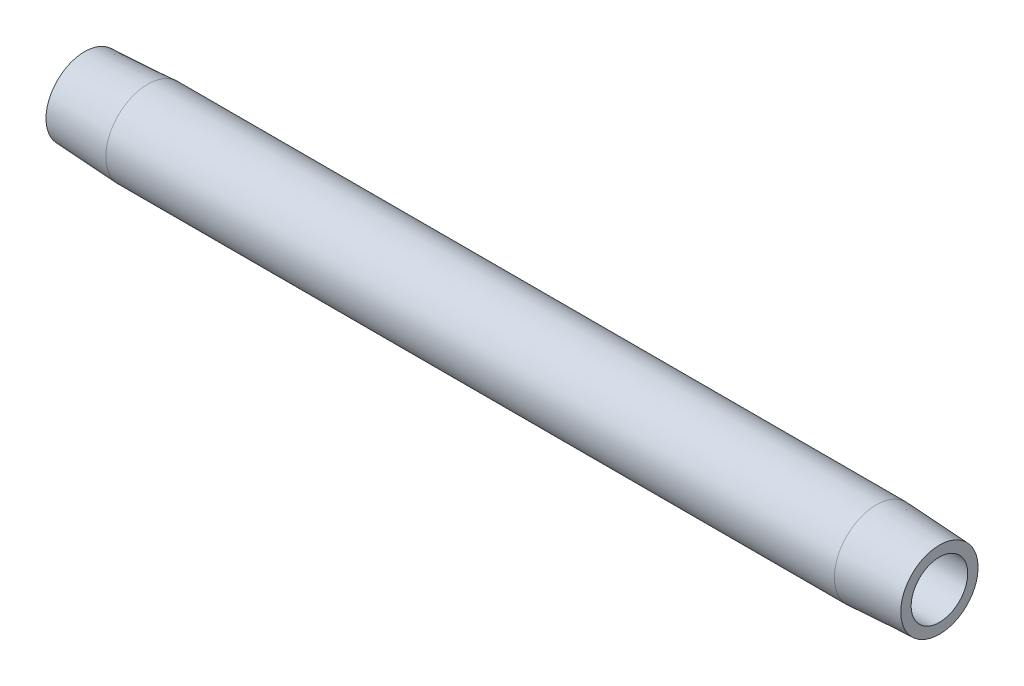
from build123d import *


with BuildPart() as part:
    # Sketch1 → Revolve1 (revolve)
    with BuildSketch(Plane(origin=(0, 0, 0), x_dir=(1, 0, 0), z_dir=(0, 1, 0)), mode=Mode.PRIVATE) as revolve1_sk:
        Polygon((139.7, 4.622776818), (0, 4.622776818), (0, 6.317526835), (10.3124, 6.857976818), (129.3876, 6.857976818), (139.7, 6.317526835), align=None)
    revolve(revolve1_sk.sketch.rotate(Axis((-6.375994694, 0, 0), (1, 0, 0)), 180), axis=Axis((-6.375994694, 0, 0), (1, 0, 0)))


solid = part.part
